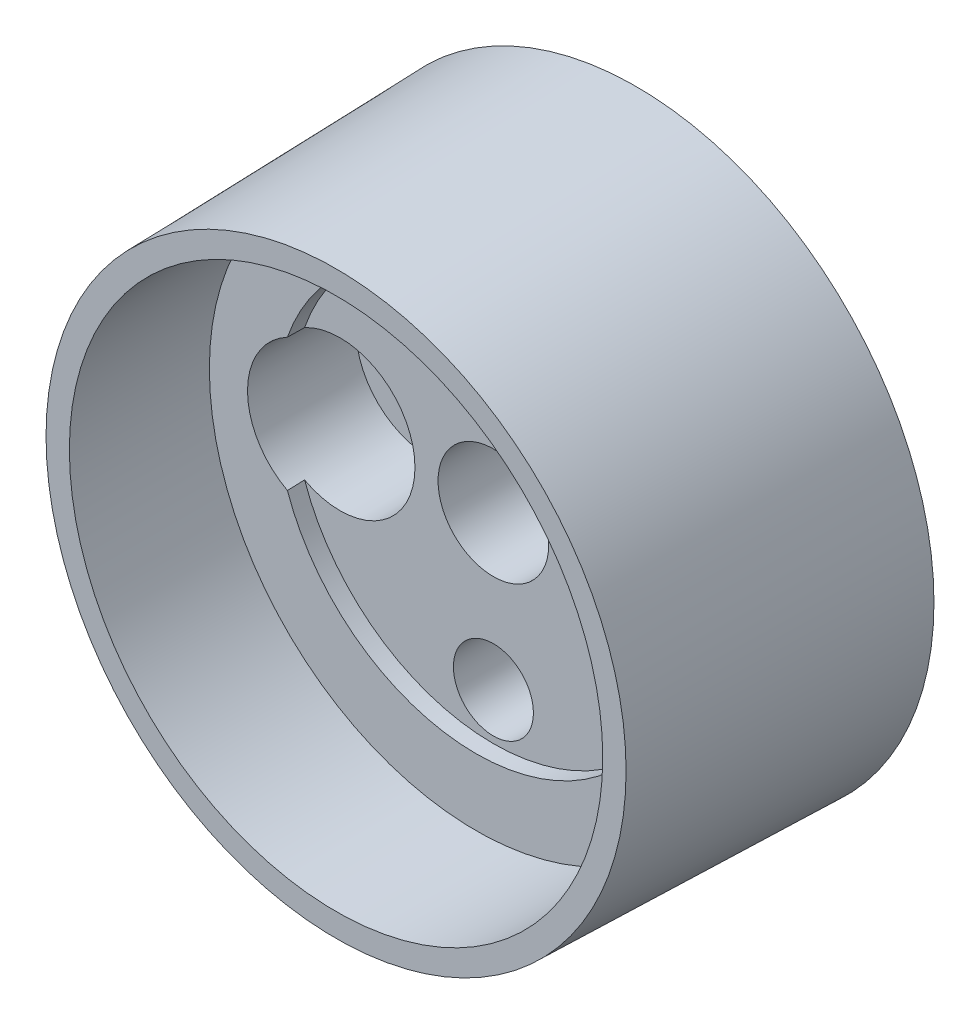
ISO-10303-21;
HEADER;
FILE_DESCRIPTION(('STEP AP214'),'2;1');
FILE_NAME('part.step','',(''),(''),'','','');
FILE_SCHEMA(('AUTOMOTIVE_DESIGN { 1 0 10303 214 1 1 1 1 }'));
ENDSEC;
DATA;
#1=APPLICATION_CONTEXT('core data for automotive mechanical design processes');
#2=APPLICATION_PROTOCOL_DEFINITION('international standard','automotive_design',2000,#1);
#3=PRODUCT_CONTEXT('',#1,'mechanical');
#4=PRODUCT('Part','Part','',(#3));
#5=PRODUCT_RELATED_PRODUCT_CATEGORY('part','',(#4));
#6=PRODUCT_DEFINITION_FORMATION('','',#4);
#7=PRODUCT_DEFINITION_CONTEXT('part definition',#1,'design');
#8=PRODUCT_DEFINITION('design','',#6,#7);
#9=PRODUCT_DEFINITION_SHAPE('','',#8);
#10=(LENGTH_UNIT() NAMED_UNIT(*) SI_UNIT(.MILLI.,.METRE.));
#11=(NAMED_UNIT(*) PLANE_ANGLE_UNIT() SI_UNIT($,.RADIAN.));
#12=(NAMED_UNIT(*) SI_UNIT($,.STERADIAN.) SOLID_ANGLE_UNIT());
#13=UNCERTAINTY_MEASURE_WITH_UNIT(LENGTH_MEASURE(1.E-05),#10,'distance_accuracy_value','');
#14=(GEOMETRIC_REPRESENTATION_CONTEXT(3) GLOBAL_UNCERTAINTY_ASSIGNED_CONTEXT((#13)) GLOBAL_UNIT_ASSIGNED_CONTEXT((#10,
#11,#12)) REPRESENTATION_CONTEXT('',''));
#15=CARTESIAN_POINT('',(0.,0.,0.));
#16=DIRECTION('',(0.,0.,1.));
#17=DIRECTION('',(1.,0.,0.));
#18=AXIS2_PLACEMENT_3D('',#15,#16,#17);
#19=CARTESIAN_POINT('',(0.,0.,22.5));
#20=DIRECTION('',(0.,0.,1.));
#21=DIRECTION('',(1.,0.,0.));
#22=AXIS2_PLACEMENT_3D('',#19,#20,#21);
#23=CYLINDRICAL_SURFACE('',#22,15.);
#24=CARTESIAN_POINT('',(0.,0.,12.));
#25=DIRECTION('',(0.,0.,1.));
#26=DIRECTION('',(1.,0.,0.));
#27=AXIS2_PLACEMENT_3D('',#24,#25,#26);
#28=CIRCLE('',#27,15.);
#29=CARTESIAN_POINT('',(-14.1497589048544,-4.97838557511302,12.));
#30=VERTEX_POINT('',#29);
#31=CARTESIAN_POINT('',(14.1497589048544,-4.97838557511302,12.));
#32=VERTEX_POINT('',#31);
#33=EDGE_CURVE('E59',#30,#32,#28,.T.);
#34=ORIENTED_EDGE('',*,*,#33,.T.);
#35=CARTESIAN_POINT('',(14.14970155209,-4.97854858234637,12.0067));
#36=CARTESIAN_POINT('',(14.1515753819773,-4.97322292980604,11.7877998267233));
#37=CARTESIAN_POINT('',(14.1534473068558,-4.9678930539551,11.5688997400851));
#38=CARTESIAN_POINT('',(14.1571873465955,-4.95722485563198,11.1310997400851));
#39=CARTESIAN_POINT('',(14.1590554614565,-4.95188653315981,10.9121998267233));
#40=CARTESIAN_POINT('',(14.1609216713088,-4.94654398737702,10.6933));
#41=B_SPLINE_CURVE_WITH_KNOTS('',3,(#35,#36,#37,#38,#39,#40),.UNSPECIFIED.,.F.,.F.,(4,2,4),(0.,
0.656918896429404,1.31383779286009),.UNSPECIFIED.);
#42=CARTESIAN_POINT('',(14.1608645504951,-4.94670750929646,10.7));
#43=VERTEX_POINT('',#42);
#44=EDGE_CURVE('E68',#32,#43,#41,.T.);
#45=ORIENTED_EDGE('',*,*,#44,.T.);
#46=CARTESIAN_POINT('',(0.,0.,10.7));
#47=DIRECTION('',(0.,0.,1.));
#48=DIRECTION('',(1.,0.,0.));
#49=AXIS2_PLACEMENT_3D('',#46,#47,#48);
#50=CIRCLE('',#49,15.);
#51=CARTESIAN_POINT('',(-14.1608645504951,-4.94670750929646,10.7));
#52=VERTEX_POINT('',#51);
#53=EDGE_CURVE('E58',#52,#43,#50,.T.);
#54=ORIENTED_EDGE('',*,*,#53,.F.);
#55=CARTESIAN_POINT('',(-14.1609216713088,-4.94654398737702,10.6933));
#56=CARTESIAN_POINT('',(-14.1590554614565,-4.95188653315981,10.9121998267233));
#57=CARTESIAN_POINT('',(-14.1571873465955,-4.95722485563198,11.1310997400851));
#58=CARTESIAN_POINT('',(-14.1534473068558,-4.9678930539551,11.5688997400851));
#59=CARTESIAN_POINT('',(-14.1515753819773,-4.97322292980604,11.7877998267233));
#60=CARTESIAN_POINT('',(-14.14970155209,-4.97854858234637,12.0067));
#61=B_SPLINE_CURVE_WITH_KNOTS('',3,(#55,#56,#57,#58,#59,#60),.UNSPECIFIED.,.F.,.F.,(4,2,4),(0.,
0.656918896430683,1.31383779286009),.UNSPECIFIED.);
#62=EDGE_CURVE('E115',#52,#30,#61,.T.);
#63=ORIENTED_EDGE('',*,*,#62,.T.);
#64=EDGE_LOOP('',(#34,#45,#54,#63));
#65=FACE_BOUND('',#64,.T.);
#66=ADVANCED_FACE('F14',(#65),#23,.F.);
#67=CARTESIAN_POINT('',(14.1497589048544,4.97838557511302,12.));
#68=VERTEX_POINT('',#67);
#69=CARTESIAN_POINT('',(-14.1497589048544,4.97838557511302,12.));
#70=VERTEX_POINT('',#69);
#71=EDGE_CURVE('E51',#68,#70,#28,.T.);
#72=ORIENTED_EDGE('',*,*,#71,.T.);
#73=CARTESIAN_POINT('',(-14.14970155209,4.97854858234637,12.0067));
#74=CARTESIAN_POINT('',(-14.1515753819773,4.97322292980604,11.7877998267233));
#75=CARTESIAN_POINT('',(-14.1534473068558,4.9678930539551,11.5688997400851));
#76=CARTESIAN_POINT('',(-14.1571873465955,4.95722485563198,11.1310997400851));
#77=CARTESIAN_POINT('',(-14.1590554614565,4.95188653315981,10.9121998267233));
#78=CARTESIAN_POINT('',(-14.1609216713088,4.94654398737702,10.6933));
#79=B_SPLINE_CURVE_WITH_KNOTS('',3,(#73,#74,#75,#76,#77,#78),.UNSPECIFIED.,.F.,.F.,(4,2,4),(0.,
0.656918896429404,1.31383779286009),.UNSPECIFIED.);
#80=CARTESIAN_POINT('',(-14.1608645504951,4.94670750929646,10.7));
#81=VERTEX_POINT('',#80);
#82=EDGE_CURVE('E29',#70,#81,#79,.T.);
#83=ORIENTED_EDGE('',*,*,#82,.T.);
#84=CARTESIAN_POINT('',(14.1608645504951,4.94670750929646,10.7));
#85=VERTEX_POINT('',#84);
#86=EDGE_CURVE('E72',#85,#81,#50,.T.);
#87=ORIENTED_EDGE('',*,*,#86,.F.);
#88=CARTESIAN_POINT('',(14.1609216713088,4.94654398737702,10.6933));
#89=CARTESIAN_POINT('',(14.1590554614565,4.95188653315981,10.9121998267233));
#90=CARTESIAN_POINT('',(14.1571873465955,4.95722485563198,11.1310997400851));
#91=CARTESIAN_POINT('',(14.1534473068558,4.9678930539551,11.5688997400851));
#92=CARTESIAN_POINT('',(14.1515753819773,4.97322292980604,11.7877998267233));
#93=CARTESIAN_POINT('',(14.14970155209,4.97854858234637,12.0067));
#94=B_SPLINE_CURVE_WITH_KNOTS('',3,(#88,#89,#90,#91,#92,#93),.UNSPECIFIED.,.F.,.F.,(4,2,4),(0.,
0.656918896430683,1.31383779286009),.UNSPECIFIED.);
#95=EDGE_CURVE('E65',#85,#68,#94,.T.);
#96=ORIENTED_EDGE('',*,*,#95,.T.);
#97=EDGE_LOOP('',(#72,#83,#87,#96));
#98=FACE_BOUND('',#97,.T.);
#99=ADVANCED_FACE('F70',(#98),#23,.F.);
#100=CARTESIAN_POINT('',(0.,22.3391832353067,0.));
#101=DIRECTION('',(0.,0.,-1.));
#102=DIRECTION('',(-1.,0.,0.));
#103=AXIS2_PLACEMENT_3D('',#100,#101,#102);
#104=PLANE('',#103);
#105=CARTESIAN_POINT('',(0.,0.,0.));
#106=DIRECTION('',(0.,0.,1.));
#107=DIRECTION('',(1.,0.,0.));
#108=AXIS2_PLACEMENT_3D('',#105,#106,#107);
#109=CIRCLE('',#108,4.15);
#110=CARTESIAN_POINT('',(4.15,0.,0.));
#111=VERTEX_POINT('',#110);
#112=EDGE_CURVE('E150',#111,#111,#109,.T.);
#113=ORIENTED_EDGE('',*,*,#112,.T.);
#114=EDGE_LOOP('',(#113));
#115=FACE_BOUND('',#114,.T.);
#116=CARTESIAN_POINT('',(0.,11.5,0.));
#117=DIRECTION('',(0.,0.,1.));
#118=DIRECTION('',(1.,0.,0.));
#119=AXIS2_PLACEMENT_3D('',#116,#117,#118);
#120=CIRCLE('',#119,3.);
#121=CARTESIAN_POINT('',(3.,11.5,0.));
#122=VERTEX_POINT('',#121);
#123=EDGE_CURVE('E131',#122,#122,#120,.T.);
#124=ORIENTED_EDGE('',*,*,#123,.T.);
#125=EDGE_LOOP('',(#124));
#126=FACE_BOUND('',#125,.T.);
#127=CARTESIAN_POINT('',(11.5,0.,0.));
#128=DIRECTION('',(0.,0.,1.));
#129=DIRECTION('',(1.,0.,0.));
#130=AXIS2_PLACEMENT_3D('',#127,#128,#129);
#131=CIRCLE('',#130,3.00008569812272);
#132=CARTESIAN_POINT('',(14.5000856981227,0.,0.));
#133=VERTEX_POINT('',#132);
#134=EDGE_CURVE('E73',#133,#133,#131,.T.);
#135=ORIENTED_EDGE('',*,*,#134,.T.);
#136=EDGE_LOOP('',(#135));
#137=FACE_BOUND('',#136,.T.);
#138=CARTESIAN_POINT('',(-11.5,0.,0.));
#139=DIRECTION('',(0.,0.,1.));
#140=DIRECTION('',(1.,0.,0.));
#141=AXIS2_PLACEMENT_3D('',#138,#139,#140);
#142=CIRCLE('',#141,3.00008569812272);
#143=CARTESIAN_POINT('',(-8.49991430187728,0.,0.));
#144=VERTEX_POINT('',#143);
#145=EDGE_CURVE('E209',#144,#144,#142,.T.);
#146=ORIENTED_EDGE('',*,*,#145,.T.);
#147=EDGE_LOOP('',(#146));
#148=FACE_BOUND('',#147,.T.);
#149=CARTESIAN_POINT('',(0.,-11.5,0.));
#150=DIRECTION('',(0.,0.,1.));
#151=DIRECTION('',(1.,0.,0.));
#152=AXIS2_PLACEMENT_3D('',#149,#150,#151);
#153=CIRCLE('',#152,3.);
#154=CARTESIAN_POINT('',(3.,-11.5,0.));
#155=VERTEX_POINT('',#154);
#156=EDGE_CURVE('E128',#155,#155,#153,.T.);
#157=ORIENTED_EDGE('',*,*,#156,.T.);
#158=EDGE_LOOP('',(#157));
#159=FACE_BOUND('',#158,.T.);
#160=CARTESIAN_POINT('',(0.,0.,0.));
#161=DIRECTION('',(0.,0.,1.));
#162=DIRECTION('',(1.,0.,0.));
#163=AXIS2_PLACEMENT_3D('',#160,#161,#162);
#164=CIRCLE('',#163,22.3391832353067);
#165=CARTESIAN_POINT('',(22.3391832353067,0.,0.));
#166=VERTEX_POINT('',#165);
#167=EDGE_CURVE('E134',#166,#166,#164,.T.);
#168=ORIENTED_EDGE('',*,*,#167,.F.);
#169=EDGE_LOOP('',(#168));
#170=FACE_BOUND('',#169,.T.);
#171=ADVANCED_FACE('F16',(#115,#126,#137,#148,#159,#170),#104,.T.);
#172=CARTESIAN_POINT('',(0.,0.,22.5));
#173=DIRECTION('',(0.,0.,1.));
#174=DIRECTION('',(1.,0.,0.));
#175=AXIS2_PLACEMENT_3D('',#172,#173,#174);
#176=CYLINDRICAL_SURFACE('',#175,4.15);
#177=CARTESIAN_POINT('',(0.,0.,10.7));
#178=DIRECTION('',(0.,0.,1.));
#179=DIRECTION('',(1.,0.,0.));
#180=AXIS2_PLACEMENT_3D('',#177,#178,#179);
#181=CIRCLE('',#180,4.15);
#182=CARTESIAN_POINT('',(4.15,0.,10.7));
#183=VERTEX_POINT('',#182);
#184=EDGE_CURVE('E147',#183,#183,#181,.T.);
#185=ORIENTED_EDGE('',*,*,#184,.T.);
#186=EDGE_LOOP('',(#185));
#187=FACE_BOUND('',#186,.T.);
#188=ORIENTED_EDGE('',*,*,#112,.F.);
#189=EDGE_LOOP('',(#188));
#190=FACE_BOUND('',#189,.T.);
#191=ADVANCED_FACE('F173',(#187,#190),#176,.F.);
#192=CARTESIAN_POINT('',(0.,4.15,10.7));
#193=DIRECTION('',(0.,0.,1.));
#194=DIRECTION('',(1.,0.,0.));
#195=AXIS2_PLACEMENT_3D('',#192,#193,#194);
#196=PLANE('',#195);
#197=CARTESIAN_POINT('',(11.5,0.,10.7));
#198=DIRECTION('',(0.,0.,1.));
#199=DIRECTION('',(1.,0.,0.));
#200=AXIS2_PLACEMENT_3D('',#197,#198,#199);
#201=CIRCLE('',#200,5.61694893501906);
#202=EDGE_CURVE('E75',#43,#85,#201,.F.);
#203=ORIENTED_EDGE('',*,*,#202,.T.);
#204=ORIENTED_EDGE('',*,*,#86,.T.);
#205=CARTESIAN_POINT('',(-11.5,0.,10.7));
#206=DIRECTION('',(0.,0.,1.));
#207=DIRECTION('',(1.,0.,0.));
#208=AXIS2_PLACEMENT_3D('',#205,#206,#207);
#209=CIRCLE('',#208,5.61694893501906);
#210=EDGE_CURVE('E34',#81,#52,#209,.F.);
#211=ORIENTED_EDGE('',*,*,#210,.T.);
#212=ORIENTED_EDGE('',*,*,#53,.T.);
#213=EDGE_LOOP('',(#203,#204,#211,#212));
#214=FACE_BOUND('',#213,.T.);
#215=CARTESIAN_POINT('',(0.,11.5,10.7));
#216=DIRECTION('',(0.,0.,1.));
#217=DIRECTION('',(1.,0.,0.));
#218=AXIS2_PLACEMENT_3D('',#215,#216,#217);
#219=CIRCLE('',#218,3.);
#220=CARTESIAN_POINT('',(3.,11.5,10.7));
#221=VERTEX_POINT('',#220);
#222=EDGE_CURVE('E153',#221,#221,#219,.F.);
#223=ORIENTED_EDGE('',*,*,#222,.T.);
#224=EDGE_LOOP('',(#223));
#225=FACE_BOUND('',#224,.T.);
#226=CARTESIAN_POINT('',(0.,-11.5,10.7));
#227=DIRECTION('',(0.,0.,1.));
#228=DIRECTION('',(1.,0.,0.));
#229=AXIS2_PLACEMENT_3D('',#226,#227,#228);
#230=CIRCLE('',#229,3.);
#231=CARTESIAN_POINT('',(3.,-11.5,10.7));
#232=VERTEX_POINT('',#231);
#233=EDGE_CURVE('E156',#232,#232,#230,.F.);
#234=ORIENTED_EDGE('',*,*,#233,.T.);
#235=EDGE_LOOP('',(#234));
#236=FACE_BOUND('',#235,.T.);
#237=ORIENTED_EDGE('',*,*,#184,.F.);
#238=EDGE_LOOP('',(#237));
#239=FACE_BOUND('',#238,.T.);
#240=ADVANCED_FACE('F160',(#214,#225,#236,#239),#196,.T.);
#241=CARTESIAN_POINT('',(0.,15.,12.));
#242=DIRECTION('',(0.,0.,1.));
#243=DIRECTION('',(1.,0.,0.));
#244=AXIS2_PLACEMENT_3D('',#241,#242,#243);
#245=PLANE('',#244);
#246=CARTESIAN_POINT('',(0.,0.,12.));
#247=DIRECTION('',(0.,0.,1.));
#248=DIRECTION('',(1.,0.,0.));
#249=AXIS2_PLACEMENT_3D('',#246,#247,#248);
#250=CIRCLE('',#249,20.);
#251=CARTESIAN_POINT('',(20.,0.,12.));
#252=VERTEX_POINT('',#251);
#253=EDGE_CURVE('E143',#252,#252,#250,.T.);
#254=ORIENTED_EDGE('',*,*,#253,.T.);
#255=EDGE_LOOP('',(#254));
#256=FACE_BOUND('',#255,.T.);
#257=CARTESIAN_POINT('',(11.5,0.,12.));
#258=DIRECTION('',(0.,0.,1.));
#259=DIRECTION('',(1.,0.,0.));
#260=AXIS2_PLACEMENT_3D('',#257,#258,#259);
#261=CIRCLE('',#260,5.63964051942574);
#262=EDGE_CURVE('E9',#68,#32,#261,.F.);
#263=ORIENTED_EDGE('',*,*,#262,.T.);
#264=ORIENTED_EDGE('',*,*,#33,.F.);
#265=CARTESIAN_POINT('',(-11.5,0.,12.));
#266=DIRECTION('',(0.,0.,1.));
#267=DIRECTION('',(1.,0.,0.));
#268=AXIS2_PLACEMENT_3D('',#265,#266,#267);
#269=CIRCLE('',#268,5.63964051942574);
#270=EDGE_CURVE('E22',#30,#70,#269,.F.);
#271=ORIENTED_EDGE('',*,*,#270,.T.);
#272=ORIENTED_EDGE('',*,*,#71,.F.);
#273=EDGE_LOOP('',(#263,#264,#271,#272));
#274=FACE_BOUND('',#273,.T.);
#275=ADVANCED_FACE('F53',(#256,#274),#245,.T.);
#276=CARTESIAN_POINT('',(0.,0.,22.5));
#277=DIRECTION('',(0.,0.,1.));
#278=DIRECTION('',(1.,0.,0.));
#279=AXIS2_PLACEMENT_3D('',#276,#277,#278);
#280=CYLINDRICAL_SURFACE('',#279,20.);
#281=CARTESIAN_POINT('',(0.,0.,22.5));
#282=DIRECTION('',(0.,0.,1.));
#283=DIRECTION('',(1.,0.,0.));
#284=AXIS2_PLACEMENT_3D('',#281,#282,#283);
#285=CIRCLE('',#284,20.);
#286=CARTESIAN_POINT('',(20.,0.,22.5));
#287=VERTEX_POINT('',#286);
#288=EDGE_CURVE('E140',#287,#287,#285,.T.);
#289=ORIENTED_EDGE('',*,*,#288,.T.);
#290=EDGE_LOOP('',(#289));
#291=FACE_BOUND('',#290,.T.);
#292=ORIENTED_EDGE('',*,*,#253,.F.);
#293=EDGE_LOOP('',(#292));
#294=FACE_BOUND('',#293,.T.);
#295=ADVANCED_FACE('F186',(#291,#294),#280,.F.);
#296=CARTESIAN_POINT('',(0.,20.,22.5));
#297=DIRECTION('',(0.,0.,1.));
#298=DIRECTION('',(1.,0.,0.));
#299=AXIS2_PLACEMENT_3D('',#296,#297,#298);
#300=PLANE('',#299);
#301=CARTESIAN_POINT('',(0.,0.,22.5));
#302=DIRECTION('',(0.,0.,1.));
#303=DIRECTION('',(1.,0.,0.));
#304=AXIS2_PLACEMENT_3D('',#301,#302,#303);
#305=CIRCLE('',#304,21.75);
#306=CARTESIAN_POINT('',(21.75,0.,22.5));
#307=VERTEX_POINT('',#306);
#308=EDGE_CURVE('E137',#307,#307,#305,.T.);
#309=ORIENTED_EDGE('',*,*,#308,.T.);
#310=EDGE_LOOP('',(#309));
#311=FACE_BOUND('',#310,.T.);
#312=ORIENTED_EDGE('',*,*,#288,.F.);
#313=EDGE_LOOP('',(#312));
#314=FACE_BOUND('',#313,.T.);
#315=ADVANCED_FACE('F180',(#311,#314),#300,.T.);
#316=CARTESIAN_POINT('',(0.,0.,22.5));
#317=DIRECTION('',(0.,0.,-1.));
#318=DIRECTION('',(-1.,0.,0.));
#319=AXIS2_PLACEMENT_3D('',#316,#317,#318);
#320=CONICAL_SURFACE('',#319,21.75,0.0261799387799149);
#321=ORIENTED_EDGE('',*,*,#167,.T.);
#322=EDGE_LOOP('',(#321));
#323=FACE_BOUND('',#322,.T.);
#324=ORIENTED_EDGE('',*,*,#308,.F.);
#325=EDGE_LOOP('',(#324));
#326=FACE_BOUND('',#325,.T.);
#327=ADVANCED_FACE('F177',(#323,#326),#320,.T.);
#328=CARTESIAN_POINT('',(0.,11.5,22.8));
#329=DIRECTION('',(0.,0.,1.));
#330=DIRECTION('',(1.,0.,0.));
#331=AXIS2_PLACEMENT_3D('',#328,#329,#330);
#332=CYLINDRICAL_SURFACE('',#331,3.);
#333=ORIENTED_EDGE('',*,*,#222,.F.);
#334=EDGE_LOOP('',(#333));
#335=FACE_BOUND('',#334,.T.);
#336=ORIENTED_EDGE('',*,*,#123,.F.);
#337=EDGE_LOOP('',(#336));
#338=FACE_BOUND('',#337,.T.);
#339=ADVANCED_FACE('F167',(#335,#338),#332,.F.);
#340=CARTESIAN_POINT('',(0.,-11.5,22.8));
#341=DIRECTION('',(0.,0.,1.));
#342=DIRECTION('',(1.,0.,0.));
#343=AXIS2_PLACEMENT_3D('',#340,#341,#342);
#344=CYLINDRICAL_SURFACE('',#343,3.);
#345=ORIENTED_EDGE('',*,*,#233,.F.);
#346=EDGE_LOOP('',(#345));
#347=FACE_BOUND('',#346,.T.);
#348=ORIENTED_EDGE('',*,*,#156,.F.);
#349=EDGE_LOOP('',(#348));
#350=FACE_BOUND('',#349,.T.);
#351=ADVANCED_FACE('F163',(#347,#350),#344,.F.);
#352=CARTESIAN_POINT('',(-11.5,0.,0.));
#353=DIRECTION('',(0.,0.,1.));
#354=DIRECTION('',(1.,0.,0.));
#355=AXIS2_PLACEMENT_3D('',#352,#353,#354);
#356=CONICAL_SURFACE('',#355,3.00008569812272,0.026179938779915);
#357=CARTESIAN_POINT('',(-11.5,0.,4.));
#358=DIRECTION('',(0.,0.,1.));
#359=DIRECTION('',(1.,0.,0.));
#360=AXIS2_PLACEMENT_3D('',#357,#358,#359);
#361=CIRCLE('',#360,3.10482938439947);
#362=CARTESIAN_POINT('',(-8.39517061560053,0.,4.));
#363=VERTEX_POINT('',#362);
#364=EDGE_CURVE('E211',#363,#363,#361,.T.);
#365=ORIENTED_EDGE('',*,*,#364,.T.);
#366=EDGE_LOOP('',(#365));
#367=FACE_BOUND('',#366,.T.);
#368=ORIENTED_EDGE('',*,*,#145,.F.);
#369=EDGE_LOOP('',(#368));
#370=FACE_BOUND('',#369,.T.);
#371=ADVANCED_FACE('F166',(#367,#370),#356,.F.);
#372=CARTESIAN_POINT('',(-8.39517061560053,0.,4.));
#373=DIRECTION('',(0.,0.,1.));
#374=DIRECTION('',(1.,0.,0.));
#375=AXIS2_PLACEMENT_3D('',#372,#373,#374);
#376=PLANE('',#375);
#377=CARTESIAN_POINT('',(-11.5,0.,4.));
#378=DIRECTION('',(0.,0.,1.));
#379=DIRECTION('',(1.,0.,0.));
#380=AXIS2_PLACEMENT_3D('',#377,#378,#379);
#381=CIRCLE('',#380,5.5);
#382=CARTESIAN_POINT('',(-6.,0.,4.));
#383=VERTEX_POINT('',#382);
#384=EDGE_CURVE('E215',#383,#383,#381,.T.);
#385=ORIENTED_EDGE('',*,*,#384,.T.);
#386=EDGE_LOOP('',(#385));
#387=FACE_BOUND('',#386,.T.);
#388=ORIENTED_EDGE('',*,*,#364,.F.);
#389=EDGE_LOOP('',(#388));
#390=FACE_BOUND('',#389,.T.);
#391=ADVANCED_FACE('F111',(#387,#390),#376,.T.);
#392=CARTESIAN_POINT('',(-11.5,0.,4.));
#393=DIRECTION('',(0.,0.,1.));
#394=DIRECTION('',(1.,0.,0.));
#395=AXIS2_PLACEMENT_3D('',#392,#393,#394);
#396=CONICAL_SURFACE('',#395,5.5,0.0174532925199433);
#397=ORIENTED_EDGE('',*,*,#210,.F.);
#398=ORIENTED_EDGE('',*,*,#82,.F.);
#399=ORIENTED_EDGE('',*,*,#270,.F.);
#400=ORIENTED_EDGE('',*,*,#62,.F.);
#401=EDGE_LOOP('',(#397,#398,#399,#400));
#402=FACE_BOUND('',#401,.T.);
#403=ORIENTED_EDGE('',*,*,#384,.F.);
#404=EDGE_LOOP('',(#403));
#405=FACE_BOUND('',#404,.T.);
#406=ADVANCED_FACE('F106',(#402,#405),#396,.F.);
#407=CARTESIAN_POINT('',(11.5,0.,0.));
#408=DIRECTION('',(0.,0.,1.));
#409=DIRECTION('',(1.,0.,0.));
#410=AXIS2_PLACEMENT_3D('',#407,#408,#409);
#411=CONICAL_SURFACE('',#410,3.00008569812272,0.026179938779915);
#412=CARTESIAN_POINT('',(11.5,0.,4.));
#413=DIRECTION('',(0.,0.,1.));
#414=DIRECTION('',(1.,0.,0.));
#415=AXIS2_PLACEMENT_3D('',#412,#413,#414);
#416=CIRCLE('',#415,3.10482938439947);
#417=CARTESIAN_POINT('',(14.6048293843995,0.,4.));
#418=VERTEX_POINT('',#417);
#419=EDGE_CURVE('E78',#418,#418,#416,.T.);
#420=ORIENTED_EDGE('',*,*,#419,.T.);
#421=EDGE_LOOP('',(#420));
#422=FACE_BOUND('',#421,.T.);
#423=ORIENTED_EDGE('',*,*,#134,.F.);
#424=EDGE_LOOP('',(#423));
#425=FACE_BOUND('',#424,.T.);
#426=ADVANCED_FACE('F102',(#422,#425),#411,.F.);
#427=CARTESIAN_POINT('',(14.6048293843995,0.,4.));
#428=DIRECTION('',(0.,0.,1.));
#429=DIRECTION('',(1.,0.,0.));
#430=AXIS2_PLACEMENT_3D('',#427,#428,#429);
#431=PLANE('',#430);
#432=CARTESIAN_POINT('',(11.5,0.,4.));
#433=DIRECTION('',(0.,0.,1.));
#434=DIRECTION('',(1.,0.,0.));
#435=AXIS2_PLACEMENT_3D('',#432,#433,#434);
#436=CIRCLE('',#435,5.5);
#437=CARTESIAN_POINT('',(17.,0.,4.));
#438=VERTEX_POINT('',#437);
#439=EDGE_CURVE('E352',#438,#438,#436,.T.);
#440=ORIENTED_EDGE('',*,*,#439,.T.);
#441=EDGE_LOOP('',(#440));
#442=FACE_BOUND('',#441,.T.);
#443=ORIENTED_EDGE('',*,*,#419,.F.);
#444=EDGE_LOOP('',(#443));
#445=FACE_BOUND('',#444,.T.);
#446=ADVANCED_FACE('F98',(#442,#445),#431,.T.);
#447=CARTESIAN_POINT('',(11.5,0.,4.));
#448=DIRECTION('',(0.,0.,1.));
#449=DIRECTION('',(1.,0.,0.));
#450=AXIS2_PLACEMENT_3D('',#447,#448,#449);
#451=CONICAL_SURFACE('',#450,5.5,0.0174532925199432);
#452=ORIENTED_EDGE('',*,*,#44,.F.);
#453=ORIENTED_EDGE('',*,*,#262,.F.);
#454=ORIENTED_EDGE('',*,*,#95,.F.);
#455=ORIENTED_EDGE('',*,*,#202,.F.);
#456=EDGE_LOOP('',(#452,#453,#454,#455));
#457=FACE_BOUND('',#456,.T.);
#458=ORIENTED_EDGE('',*,*,#439,.F.);
#459=EDGE_LOOP('',(#458));
#460=FACE_BOUND('',#459,.T.);
#461=ADVANCED_FACE('F63',(#457,#460),#451,.F.);
#462=CLOSED_SHELL('',(#66,#99,#171,#191,#240,#275,#295,#315,#327,#339,#351,#371,#391,#406,#426,
#446,#461));
#463=MANIFOLD_SOLID_BREP('B1',#462);
#464=ADVANCED_BREP_SHAPE_REPRESENTATION('',(#18,#463),#14);
#465=SHAPE_DEFINITION_REPRESENTATION(#9,#464);
ENDSEC;
END-ISO-10303-21;
